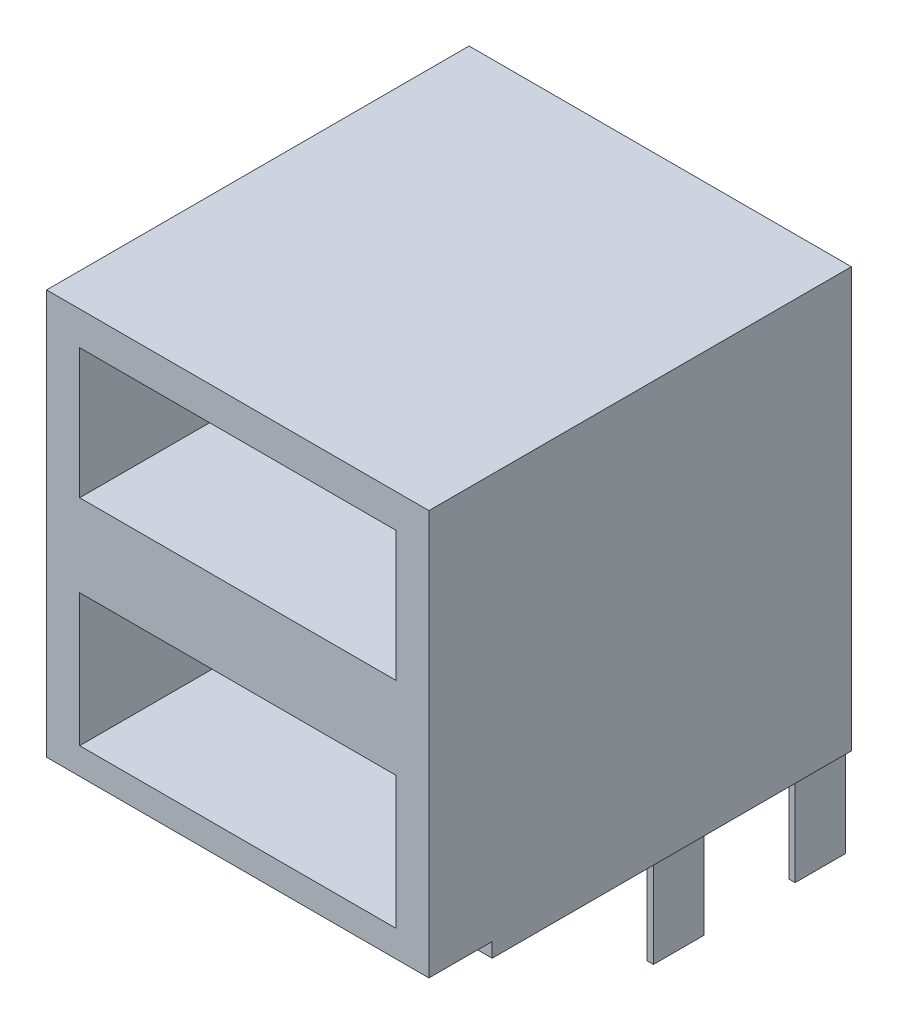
ISO-10303-21;
HEADER;
FILE_DESCRIPTION(('STEP AP214'),'2;1');
FILE_NAME('part.step','',(''),(''),'','','');
FILE_SCHEMA(('AUTOMOTIVE_DESIGN { 1 0 10303 214 1 1 1 1 }'));
ENDSEC;
DATA;
#1=APPLICATION_CONTEXT('core data for automotive mechanical design processes');
#2=APPLICATION_PROTOCOL_DEFINITION('international standard','automotive_design',2000,#1);
#3=PRODUCT_CONTEXT('',#1,'mechanical');
#4=PRODUCT('Part','Part','',(#3));
#5=PRODUCT_RELATED_PRODUCT_CATEGORY('part','',(#4));
#6=PRODUCT_DEFINITION_FORMATION('','',#4);
#7=PRODUCT_DEFINITION_CONTEXT('part definition',#1,'design');
#8=PRODUCT_DEFINITION('design','',#6,#7);
#9=PRODUCT_DEFINITION_SHAPE('','',#8);
#10=(LENGTH_UNIT() NAMED_UNIT(*) SI_UNIT(.MILLI.,.METRE.));
#11=(NAMED_UNIT(*) PLANE_ANGLE_UNIT() SI_UNIT($,.RADIAN.));
#12=(NAMED_UNIT(*) SI_UNIT($,.STERADIAN.) SOLID_ANGLE_UNIT());
#13=UNCERTAINTY_MEASURE_WITH_UNIT(LENGTH_MEASURE(1.E-05),#10,'distance_accuracy_value','');
#14=(GEOMETRIC_REPRESENTATION_CONTEXT(3) GLOBAL_UNCERTAINTY_ASSIGNED_CONTEXT((#13)) GLOBAL_UNIT_ASSIGNED_CONTEXT((#10,
#11,#12)) REPRESENTATION_CONTEXT('',''));
#15=CARTESIAN_POINT('',(0.,0.,0.));
#16=DIRECTION('',(0.,0.,1.));
#17=DIRECTION('',(1.,0.,0.));
#18=AXIS2_PLACEMENT_3D('',#15,#16,#17);
#19=CARTESIAN_POINT('',(-6.35,10.2743,-3.2766));
#20=DIRECTION('',(0.,0.,1.));
#21=DIRECTION('',(0.,-1.,0.));
#22=AXIS2_PLACEMENT_3D('',#19,#20,#21);
#23=PLANE('',#22);
#24=DIRECTION('',(1.,0.,0.));
#25=VECTOR('',#24,1.);
#26=CARTESIAN_POINT('',(-6.35,10.2743,-3.2766));
#27=LINE('',#26,#25);
#28=CARTESIAN_POINT('',(-6.35,10.2743,-3.27660000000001));
#29=VERTEX_POINT('',#28);
#30=CARTESIAN_POINT('',(6.35,10.2743,-3.2766));
#31=VERTEX_POINT('',#30);
#32=EDGE_CURVE('E223',#29,#31,#27,.T.);
#33=ORIENTED_EDGE('',*,*,#32,.T.);
#34=DIRECTION('',(0.,1.,0.));
#35=VECTOR('',#34,1.);
#36=CARTESIAN_POINT('',(6.35,15.494,-3.2766));
#37=LINE('',#36,#35);
#38=CARTESIAN_POINT('',(6.35,15.494,-3.27660000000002));
#39=VERTEX_POINT('',#38);
#40=EDGE_CURVE('E373',#31,#39,#37,.T.);
#41=ORIENTED_EDGE('',*,*,#40,.T.);
#42=DIRECTION('',(1.,0.,0.));
#43=VECTOR('',#42,1.);
#44=CARTESIAN_POINT('',(-6.35,15.494,-3.27660000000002));
#45=LINE('',#44,#43);
#46=CARTESIAN_POINT('',(-6.35,15.494,-3.27660000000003));
#47=VERTEX_POINT('',#46);
#48=EDGE_CURVE('E228',#39,#47,#45,.F.);
#49=ORIENTED_EDGE('',*,*,#48,.T.);
#50=DIRECTION('',(0.,1.,0.));
#51=VECTOR('',#50,1.);
#52=CARTESIAN_POINT('',(-6.35,15.494,-3.27660000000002));
#53=LINE('',#52,#51);
#54=EDGE_CURVE('E226',#47,#29,#53,.F.);
#55=ORIENTED_EDGE('',*,*,#54,.T.);
#56=EDGE_LOOP('',(#33,#41,#49,#55));
#57=FACE_BOUND('',#56,.T.);
#58=ADVANCED_FACE('F17',(#57),#23,.T.);
#59=CARTESIAN_POINT('',(-6.35,6.9723,-3.2766));
#60=DIRECTION('',(0.,0.,1.));
#61=DIRECTION('',(0.,-1.,0.));
#62=AXIS2_PLACEMENT_3D('',#59,#60,#61);
#63=PLANE('',#62);
#64=DIRECTION('',(1.,0.,0.));
#65=VECTOR('',#64,1.);
#66=CARTESIAN_POINT('',(-6.35,1.651,-3.27659999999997));
#67=LINE('',#66,#65);
#68=CARTESIAN_POINT('',(-6.35,1.651,-3.27659999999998));
#69=VERTEX_POINT('',#68);
#70=CARTESIAN_POINT('',(6.35,1.65099999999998,-3.27659999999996));
#71=VERTEX_POINT('',#70);
#72=EDGE_CURVE('E360',#69,#71,#67,.T.);
#73=ORIENTED_EDGE('',*,*,#72,.T.);
#74=DIRECTION('',(0.,1.,0.));
#75=VECTOR('',#74,1.);
#76=CARTESIAN_POINT('',(6.35,6.9723,-3.27659999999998));
#77=LINE('',#76,#75);
#78=CARTESIAN_POINT('',(6.35,6.9723,-3.27659999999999));
#79=VERTEX_POINT('',#78);
#80=EDGE_CURVE('E355',#71,#79,#77,.T.);
#81=ORIENTED_EDGE('',*,*,#80,.T.);
#82=DIRECTION('',(1.,0.,0.));
#83=VECTOR('',#82,1.);
#84=CARTESIAN_POINT('',(-6.35,6.9723,-3.2766));
#85=LINE('',#84,#83);
#86=CARTESIAN_POINT('',(-6.35,6.97229999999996,-3.2766));
#87=VERTEX_POINT('',#86);
#88=EDGE_CURVE('E342',#79,#87,#85,.F.);
#89=ORIENTED_EDGE('',*,*,#88,.T.);
#90=DIRECTION('',(0.,1.,0.));
#91=VECTOR('',#90,1.);
#92=CARTESIAN_POINT('',(-6.35,6.9723,-3.2766));
#93=LINE('',#92,#91);
#94=EDGE_CURVE('E365',#87,#69,#93,.F.);
#95=ORIENTED_EDGE('',*,*,#94,.T.);
#96=EDGE_LOOP('',(#73,#81,#89,#95));
#97=FACE_BOUND('',#96,.T.);
#98=ADVANCED_FACE('F537',(#97),#63,.T.);
#99=CARTESIAN_POINT('',(3.4925,-2.8448,-4.5212));
#100=DIRECTION('',(0.,-1.,0.));
#101=DIRECTION('',(0.,0.,-1.));
#102=AXIS2_PLACEMENT_3D('',#99,#100,#101);
#103=PLANE('',#102);
#104=CARTESIAN_POINT('',(3.4925,-2.84479999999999,-4.5212));
#105=DIRECTION('',(0.,1.,0.));
#106=DIRECTION('',(0.,0.,1.));
#107=AXIS2_PLACEMENT_3D('',#104,#105,#106);
#108=CIRCLE('',#107,0.4572);
#109=CARTESIAN_POINT('',(3.4925,-2.8448,-4.064));
#110=VERTEX_POINT('',#109);
#111=EDGE_CURVE('E20',#110,#110,#108,.T.);
#112=ORIENTED_EDGE('',*,*,#111,.F.);
#113=EDGE_LOOP('',(#112));
#114=FACE_BOUND('',#113,.T.);
#115=ADVANCED_FACE('F735',(#114),#103,.T.);
#116=CARTESIAN_POINT('',(-1.0033,-2.8448,-4.5212));
#117=DIRECTION('',(0.,-1.,0.));
#118=DIRECTION('',(0.,0.,-1.));
#119=AXIS2_PLACEMENT_3D('',#116,#117,#118);
#120=PLANE('',#119);
#121=CARTESIAN_POINT('',(-1.0033,-2.84479999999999,-4.5212));
#122=DIRECTION('',(0.,1.,0.));
#123=DIRECTION('',(0.,0.,1.));
#124=AXIS2_PLACEMENT_3D('',#121,#122,#123);
#125=CIRCLE('',#124,0.4572);
#126=CARTESIAN_POINT('',(-1.0033,-2.8448,-4.064));
#127=VERTEX_POINT('',#126);
#128=EDGE_CURVE('E328',#127,#127,#125,.T.);
#129=ORIENTED_EDGE('',*,*,#128,.F.);
#130=EDGE_LOOP('',(#129));
#131=FACE_BOUND('',#130,.T.);
#132=ADVANCED_FACE('F731',(#131),#120,.T.);
#133=CARTESIAN_POINT('',(1.0033,-2.8448,-7.1374));
#134=DIRECTION('',(0.,-1.,0.));
#135=DIRECTION('',(0.,0.,-1.));
#136=AXIS2_PLACEMENT_3D('',#133,#134,#135);
#137=PLANE('',#136);
#138=CARTESIAN_POINT('',(1.0033,-2.84479999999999,-7.1374));
#139=DIRECTION('',(0.,1.,0.));
#140=DIRECTION('',(0.,0.,1.));
#141=AXIS2_PLACEMENT_3D('',#138,#139,#140);
#142=CIRCLE('',#141,0.4572);
#143=CARTESIAN_POINT('',(1.0033,-2.8448,-6.6802));
#144=VERTEX_POINT('',#143);
#145=EDGE_CURVE('E326',#144,#144,#142,.T.);
#146=ORIENTED_EDGE('',*,*,#145,.F.);
#147=EDGE_LOOP('',(#146));
#148=FACE_BOUND('',#147,.T.);
#149=ADVANCED_FACE('F727',(#148),#137,.T.);
#150=CARTESIAN_POINT('',(-3.4925,-2.8448,-7.1374));
#151=DIRECTION('',(0.,-1.,0.));
#152=DIRECTION('',(0.,0.,-1.));
#153=AXIS2_PLACEMENT_3D('',#150,#151,#152);
#154=PLANE('',#153);
#155=CARTESIAN_POINT('',(-3.4925,-2.84479999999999,-7.1374));
#156=DIRECTION('',(0.,1.,0.));
#157=DIRECTION('',(0.,0.,1.));
#158=AXIS2_PLACEMENT_3D('',#155,#156,#157);
#159=CIRCLE('',#158,0.4572);
#160=CARTESIAN_POINT('',(-3.4925,-2.8448,-6.6802));
#161=VERTEX_POINT('',#160);
#162=EDGE_CURVE('E322',#161,#161,#159,.T.);
#163=ORIENTED_EDGE('',*,*,#162,.F.);
#164=EDGE_LOOP('',(#163));
#165=FACE_BOUND('',#164,.T.);
#166=ADVANCED_FACE('F724',(#165),#154,.T.);
#167=CARTESIAN_POINT('',(7.16915,-3.7084,-0.7874));
#168=DIRECTION('',(0.,0.,-1.));
#169=DIRECTION('',(-1.,0.,0.));
#170=AXIS2_PLACEMENT_3D('',#167,#168,#169);
#171=PLANE('',#170);
#172=DIRECTION('',(0.,1.,0.));
#173=VECTOR('',#172,1.);
#174=CARTESIAN_POINT('',(7.42315,-3.7084,-0.787400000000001));
#175=LINE('',#174,#173);
#176=CARTESIAN_POINT('',(7.42315,-3.7084,-0.787400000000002));
#177=VERTEX_POINT('',#176);
#178=CARTESIAN_POINT('',(7.42315,0.,-0.787400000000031));
#179=VERTEX_POINT('',#178);
#180=EDGE_CURVE('E469',#177,#179,#175,.T.);
#181=ORIENTED_EDGE('',*,*,#180,.T.);
#182=DIRECTION('',(-1.,0.,0.));
#183=VECTOR('',#182,1.);
#184=CARTESIAN_POINT('',(7.16915,0.,-0.787400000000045));
#185=LINE('',#184,#183);
#186=CARTESIAN_POINT('',(7.16915,0.,-0.787400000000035));
#187=VERTEX_POINT('',#186);
#188=EDGE_CURVE('E278',#187,#179,#185,.F.);
#189=ORIENTED_EDGE('',*,*,#188,.F.);
#190=DIRECTION('',(0.,1.,0.));
#191=VECTOR('',#190,1.);
#192=CARTESIAN_POINT('',(7.16915,-3.7084,-0.787400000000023));
#193=LINE('',#192,#191);
#194=CARTESIAN_POINT('',(7.16915,-3.7084,-0.787400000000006));
#195=VERTEX_POINT('',#194);
#196=EDGE_CURVE('E474',#187,#195,#193,.F.);
#197=ORIENTED_EDGE('',*,*,#196,.T.);
#198=DIRECTION('',(1.,0.,0.));
#199=VECTOR('',#198,1.);
#200=CARTESIAN_POINT('',(7.16915,-3.7084,-0.7874));
#201=LINE('',#200,#199);
#202=EDGE_CURVE('E270',#195,#177,#201,.T.);
#203=ORIENTED_EDGE('',*,*,#202,.T.);
#204=EDGE_LOOP('',(#181,#189,#197,#203));
#205=FACE_BOUND('',#204,.T.);
#206=ADVANCED_FACE('F721',(#205),#171,.F.);
#207=CARTESIAN_POINT('',(7.16915,-3.7084,-2.8194));
#208=DIRECTION('',(0.,0.,1.));
#209=DIRECTION('',(1.,0.,0.));
#210=AXIS2_PLACEMENT_3D('',#207,#208,#209);
#211=PLANE('',#210);
#212=DIRECTION('',(0.,1.,0.));
#213=VECTOR('',#212,1.);
#214=CARTESIAN_POINT('',(7.16915,-3.7084,-2.8194));
#215=LINE('',#214,#213);
#216=CARTESIAN_POINT('',(7.16915,-3.70840000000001,-2.8194));
#217=VERTEX_POINT('',#216);
#218=CARTESIAN_POINT('',(7.16915,0.,-2.81940000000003));
#219=VERTEX_POINT('',#218);
#220=EDGE_CURVE('E325',#217,#219,#215,.T.);
#221=ORIENTED_EDGE('',*,*,#220,.T.);
#222=DIRECTION('',(1.,0.,0.));
#223=VECTOR('',#222,1.);
#224=CARTESIAN_POINT('',(7.16915,0.,-2.81940000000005));
#225=LINE('',#224,#223);
#226=CARTESIAN_POINT('',(7.42315,0.,-2.81940000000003));
#227=VERTEX_POINT('',#226);
#228=EDGE_CURVE('E276',#227,#219,#225,.F.);
#229=ORIENTED_EDGE('',*,*,#228,.F.);
#230=DIRECTION('',(0.,1.,0.));
#231=VECTOR('',#230,1.);
#232=CARTESIAN_POINT('',(7.42315,-3.7084,-2.81940000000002));
#233=LINE('',#232,#231);
#234=CARTESIAN_POINT('',(7.42315,-3.70840000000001,-2.8194));
#235=VERTEX_POINT('',#234);
#236=EDGE_CURVE('E466',#227,#235,#233,.F.);
#237=ORIENTED_EDGE('',*,*,#236,.T.);
#238=DIRECTION('',(1.,0.,0.));
#239=VECTOR('',#238,1.);
#240=CARTESIAN_POINT('',(7.16915,-3.70840000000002,-2.8194));
#241=LINE('',#240,#239);
#242=EDGE_CURVE('E273',#235,#217,#241,.F.);
#243=ORIENTED_EDGE('',*,*,#242,.T.);
#244=EDGE_LOOP('',(#221,#229,#237,#243));
#245=FACE_BOUND('',#244,.T.);
#246=ADVANCED_FACE('F481',(#245),#211,.F.);
#247=CARTESIAN_POINT('',(7.16915,-3.7084,-0.7874));
#248=DIRECTION('',(0.,1.,0.));
#249=DIRECTION('',(0.,0.,1.));
#250=AXIS2_PLACEMENT_3D('',#247,#248,#249);
#251=PLANE('',#250);
#252=ORIENTED_EDGE('',*,*,#202,.F.);
#253=DIRECTION('',(0.,0.,-1.));
#254=VECTOR('',#253,1.);
#255=CARTESIAN_POINT('',(7.16915,-3.7084,-2.8194));
#256=LINE('',#255,#254);
#257=EDGE_CURVE('E472',#195,#217,#256,.T.);
#258=ORIENTED_EDGE('',*,*,#257,.T.);
#259=ORIENTED_EDGE('',*,*,#242,.F.);
#260=DIRECTION('',(0.,0.,1.));
#261=VECTOR('',#260,1.);
#262=CARTESIAN_POINT('',(7.42315,-3.70840000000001,-2.8194));
#263=LINE('',#262,#261);
#264=EDGE_CURVE('E463',#235,#177,#263,.T.);
#265=ORIENTED_EDGE('',*,*,#264,.T.);
#266=EDGE_LOOP('',(#252,#258,#259,#265));
#267=FACE_BOUND('',#266,.T.);
#268=ADVANCED_FACE('F708',(#267),#251,.F.);
#269=CARTESIAN_POINT('',(-7.16915,-3.7084,-2.8194));
#270=DIRECTION('',(0.,0.,1.));
#271=DIRECTION('',(0.,-1.,0.));
#272=AXIS2_PLACEMENT_3D('',#269,#270,#271);
#273=PLANE('',#272);
#274=DIRECTION('',(0.,1.,0.));
#275=VECTOR('',#274,1.);
#276=CARTESIAN_POINT('',(-7.42315,-3.7084,-2.8194));
#277=LINE('',#276,#275);
#278=CARTESIAN_POINT('',(-7.42315,-3.7084,-2.8194));
#279=VERTEX_POINT('',#278);
#280=CARTESIAN_POINT('',(-7.42315,0.,-2.81940000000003));
#281=VERTEX_POINT('',#280);
#282=EDGE_CURVE('E451',#279,#281,#277,.T.);
#283=ORIENTED_EDGE('',*,*,#282,.T.);
#284=DIRECTION('',(1.,0.,0.));
#285=VECTOR('',#284,1.);
#286=CARTESIAN_POINT('',(-7.16915,0.,-2.81940000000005));
#287=LINE('',#286,#285);
#288=CARTESIAN_POINT('',(-7.16915,0.,-2.81940000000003));
#289=VERTEX_POINT('',#288);
#290=EDGE_CURVE('E268',#289,#281,#287,.F.);
#291=ORIENTED_EDGE('',*,*,#290,.F.);
#292=DIRECTION('',(0.,1.,0.));
#293=VECTOR('',#292,1.);
#294=CARTESIAN_POINT('',(-7.16915,-3.7084,-2.81940000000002));
#295=LINE('',#294,#293);
#296=CARTESIAN_POINT('',(-7.16915,-3.7084,-2.81940000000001));
#297=VERTEX_POINT('',#296);
#298=EDGE_CURVE('E457',#289,#297,#295,.F.);
#299=ORIENTED_EDGE('',*,*,#298,.T.);
#300=DIRECTION('',(1.,0.,0.));
#301=VECTOR('',#300,1.);
#302=CARTESIAN_POINT('',(-7.16915,-3.7084,-2.8194));
#303=LINE('',#302,#301);
#304=EDGE_CURVE('E260',#297,#279,#303,.F.);
#305=ORIENTED_EDGE('',*,*,#304,.T.);
#306=EDGE_LOOP('',(#283,#291,#299,#305));
#307=FACE_BOUND('',#306,.T.);
#308=ADVANCED_FACE('F706',(#307),#273,.F.);
#309=CARTESIAN_POINT('',(-7.16915,-3.7084,-0.7874));
#310=DIRECTION('',(0.,0.,-1.));
#311=DIRECTION('',(0.,1.,0.));
#312=AXIS2_PLACEMENT_3D('',#309,#310,#311);
#313=PLANE('',#312);
#314=DIRECTION('',(0.,1.,0.));
#315=VECTOR('',#314,1.);
#316=CARTESIAN_POINT('',(-7.16915,-3.7084,-0.7874));
#317=LINE('',#316,#315);
#318=CARTESIAN_POINT('',(-7.16915,-3.70839999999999,-0.7874));
#319=VERTEX_POINT('',#318);
#320=CARTESIAN_POINT('',(-7.16915,0.,-0.787400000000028));
#321=VERTEX_POINT('',#320);
#322=EDGE_CURVE('E460',#319,#321,#317,.T.);
#323=ORIENTED_EDGE('',*,*,#322,.T.);
#324=DIRECTION('',(1.,0.,0.));
#325=VECTOR('',#324,1.);
#326=CARTESIAN_POINT('',(-7.16915,0.,-0.787400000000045));
#327=LINE('',#326,#325);
#328=CARTESIAN_POINT('',(-7.42315,0.,-0.787400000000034));
#329=VERTEX_POINT('',#328);
#330=EDGE_CURVE('E266',#329,#321,#327,.T.);
#331=ORIENTED_EDGE('',*,*,#330,.F.);
#332=DIRECTION('',(0.,1.,0.));
#333=VECTOR('',#332,1.);
#334=CARTESIAN_POINT('',(-7.42315,-3.7084,-0.787400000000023));
#335=LINE('',#334,#333);
#336=CARTESIAN_POINT('',(-7.42315,-3.70839999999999,-0.787400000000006));
#337=VERTEX_POINT('',#336);
#338=EDGE_CURVE('E448',#329,#337,#335,.F.);
#339=ORIENTED_EDGE('',*,*,#338,.T.);
#340=DIRECTION('',(1.,0.,0.));
#341=VECTOR('',#340,1.);
#342=CARTESIAN_POINT('',(-7.16915,-3.70839999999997,-0.7874));
#343=LINE('',#342,#341);
#344=EDGE_CURVE('E263',#337,#319,#343,.T.);
#345=ORIENTED_EDGE('',*,*,#344,.T.);
#346=EDGE_LOOP('',(#323,#331,#339,#345));
#347=FACE_BOUND('',#346,.T.);
#348=ADVANCED_FACE('F701',(#347),#313,.F.);
#349=CARTESIAN_POINT('',(-7.16915,-3.7084,-2.8194));
#350=DIRECTION('',(0.,1.,0.));
#351=DIRECTION('',(0.,0.,1.));
#352=AXIS2_PLACEMENT_3D('',#349,#350,#351);
#353=PLANE('',#352);
#354=ORIENTED_EDGE('',*,*,#304,.F.);
#355=DIRECTION('',(0.,0.,1.));
#356=VECTOR('',#355,1.);
#357=CARTESIAN_POINT('',(-7.16915,-3.7084,-0.7874));
#358=LINE('',#357,#356);
#359=EDGE_CURVE('E454',#297,#319,#358,.T.);
#360=ORIENTED_EDGE('',*,*,#359,.T.);
#361=ORIENTED_EDGE('',*,*,#344,.F.);
#362=DIRECTION('',(0.,0.,-1.));
#363=VECTOR('',#362,1.);
#364=CARTESIAN_POINT('',(-7.42315,-3.70839999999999,-0.7874));
#365=LINE('',#364,#363);
#366=EDGE_CURVE('E321',#337,#279,#365,.T.);
#367=ORIENTED_EDGE('',*,*,#366,.T.);
#368=EDGE_LOOP('',(#354,#360,#361,#367));
#369=FACE_BOUND('',#368,.T.);
#370=ADVANCED_FACE('F704',(#369),#353,.F.);
#371=CARTESIAN_POINT('',(-3.4925,-2.8448,-4.5212));
#372=DIRECTION('',(0.,-1.,0.));
#373=DIRECTION('',(0.,0.,-1.));
#374=AXIS2_PLACEMENT_3D('',#371,#372,#373);
#375=PLANE('',#374);
#376=CARTESIAN_POINT('',(-3.4925,-2.84479999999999,-4.5212));
#377=DIRECTION('',(0.,1.,0.));
#378=DIRECTION('',(0.,0.,1.));
#379=AXIS2_PLACEMENT_3D('',#376,#377,#378);
#380=CIRCLE('',#379,0.4572);
#381=CARTESIAN_POINT('',(-3.4925,-2.8448,-4.064));
#382=VERTEX_POINT('',#381);
#383=EDGE_CURVE('E318',#382,#382,#380,.T.);
#384=ORIENTED_EDGE('',*,*,#383,.F.);
#385=EDGE_LOOP('',(#384));
#386=FACE_BOUND('',#385,.T.);
#387=ADVANCED_FACE('F793',(#386),#375,.T.);
#388=CARTESIAN_POINT('',(-1.0033,-2.8448,-7.1374));
#389=DIRECTION('',(0.,-1.,0.));
#390=DIRECTION('',(0.,0.,-1.));
#391=AXIS2_PLACEMENT_3D('',#388,#389,#390);
#392=PLANE('',#391);
#393=CARTESIAN_POINT('',(-1.0033,-2.84479999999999,-7.1374));
#394=DIRECTION('',(0.,1.,0.));
#395=DIRECTION('',(0.,0.,1.));
#396=AXIS2_PLACEMENT_3D('',#393,#394,#395);
#397=CIRCLE('',#396,0.4572);
#398=CARTESIAN_POINT('',(-1.0033,-2.8448,-6.6802));
#399=VERTEX_POINT('',#398);
#400=EDGE_CURVE('E315',#399,#399,#397,.T.);
#401=ORIENTED_EDGE('',*,*,#400,.F.);
#402=EDGE_LOOP('',(#401));
#403=FACE_BOUND('',#402,.T.);
#404=ADVANCED_FACE('F799',(#403),#392,.T.);
#405=CARTESIAN_POINT('',(3.4925,-2.8448,-7.1374));
#406=DIRECTION('',(0.,-1.,0.));
#407=DIRECTION('',(0.,0.,-1.));
#408=AXIS2_PLACEMENT_3D('',#405,#406,#407);
#409=PLANE('',#408);
#410=CARTESIAN_POINT('',(3.4925,-2.84479999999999,-7.1374));
#411=DIRECTION('',(0.,1.,0.));
#412=DIRECTION('',(0.,0.,1.));
#413=AXIS2_PLACEMENT_3D('',#410,#411,#412);
#414=CIRCLE('',#413,0.4572);
#415=CARTESIAN_POINT('',(3.4925,-2.8448,-6.6802));
#416=VERTEX_POINT('',#415);
#417=EDGE_CURVE('E312',#416,#416,#414,.T.);
#418=ORIENTED_EDGE('',*,*,#417,.F.);
#419=EDGE_LOOP('',(#418));
#420=FACE_BOUND('',#419,.T.);
#421=ADVANCED_FACE('F807',(#420),#409,.T.);
#422=CARTESIAN_POINT('',(1.0033,-2.8448,-4.5212));
#423=DIRECTION('',(0.,-1.,0.));
#424=DIRECTION('',(0.,0.,-1.));
#425=AXIS2_PLACEMENT_3D('',#422,#423,#424);
#426=PLANE('',#425);
#427=CARTESIAN_POINT('',(1.0033,-2.84479999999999,-4.5212));
#428=DIRECTION('',(0.,1.,0.));
#429=DIRECTION('',(0.,0.,1.));
#430=AXIS2_PLACEMENT_3D('',#427,#428,#429);
#431=CIRCLE('',#430,0.4572);
#432=CARTESIAN_POINT('',(1.0033,-2.8448,-4.064));
#433=VERTEX_POINT('',#432);
#434=EDGE_CURVE('E308',#433,#433,#431,.T.);
#435=ORIENTED_EDGE('',*,*,#434,.F.);
#436=EDGE_LOOP('',(#435));
#437=FACE_BOUND('',#436,.T.);
#438=ADVANCED_FACE('F815',(#437),#426,.T.);
#439=CARTESIAN_POINT('',(7.42315,-3.7084,-6.477));
#440=DIRECTION('',(0.,0.,-1.));
#441=DIRECTION('',(0.,1.,0.));
#442=AXIS2_PLACEMENT_3D('',#439,#440,#441);
#443=PLANE('',#442);
#444=DIRECTION('',(0.,1.,0.));
#445=VECTOR('',#444,1.);
#446=CARTESIAN_POINT('',(7.42315,-3.7084,-6.477));
#447=LINE('',#446,#445);
#448=CARTESIAN_POINT('',(7.42315,-3.7084,-6.477));
#449=VERTEX_POINT('',#448);
#450=CARTESIAN_POINT('',(7.42315,0.,-6.47700000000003));
#451=VERTEX_POINT('',#450);
#452=EDGE_CURVE('E435',#449,#451,#447,.T.);
#453=ORIENTED_EDGE('',*,*,#452,.T.);
#454=DIRECTION('',(1.,0.,0.));
#455=VECTOR('',#454,1.);
#456=CARTESIAN_POINT('',(7.42315,0.,-6.47700000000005));
#457=LINE('',#456,#455);
#458=CARTESIAN_POINT('',(7.16915,0.,-6.47700000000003));
#459=VERTEX_POINT('',#458);
#460=EDGE_CURVE('E258',#459,#451,#457,.T.);
#461=ORIENTED_EDGE('',*,*,#460,.F.);
#462=DIRECTION('',(0.,1.,0.));
#463=VECTOR('',#462,1.);
#464=CARTESIAN_POINT('',(7.16915,-3.7084,-6.47700000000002));
#465=LINE('',#464,#463);
#466=CARTESIAN_POINT('',(7.16915,-3.7084,-6.47700000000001));
#467=VERTEX_POINT('',#466);
#468=EDGE_CURVE('E429',#459,#467,#465,.F.);
#469=ORIENTED_EDGE('',*,*,#468,.T.);
#470=DIRECTION('',(1.,0.,0.));
#471=VECTOR('',#470,1.);
#472=CARTESIAN_POINT('',(7.42315,-3.7084,-6.477));
#473=LINE('',#472,#471);
#474=EDGE_CURVE('E256',#449,#467,#473,.F.);
#475=ORIENTED_EDGE('',*,*,#474,.F.);
#476=EDGE_LOOP('',(#453,#461,#469,#475));
#477=FACE_BOUND('',#476,.T.);
#478=ADVANCED_FACE('F823',(#477),#443,.F.);
#479=CARTESIAN_POINT('',(7.42315,-3.7084,-6.477));
#480=DIRECTION('',(0.,-1.,0.));
#481=DIRECTION('',(0.,0.,-1.));
#482=AXIS2_PLACEMENT_3D('',#479,#480,#481);
#483=PLANE('',#482);
#484=ORIENTED_EDGE('',*,*,#474,.T.);
#485=DIRECTION('',(0.,0.,-1.));
#486=VECTOR('',#485,1.);
#487=CARTESIAN_POINT('',(7.16915,-3.7084,-8.509));
#488=LINE('',#487,#486);
#489=CARTESIAN_POINT('',(7.16915,-3.70840000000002,-8.509));
#490=VERTEX_POINT('',#489);
#491=EDGE_CURVE('E426',#467,#490,#488,.T.);
#492=ORIENTED_EDGE('',*,*,#491,.T.);
#493=DIRECTION('',(1.,0.,0.));
#494=VECTOR('',#493,1.);
#495=CARTESIAN_POINT('',(7.42315,-3.70840000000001,-8.509));
#496=LINE('',#495,#494);
#497=CARTESIAN_POINT('',(7.42315,-3.70840000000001,-8.50900000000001));
#498=VERTEX_POINT('',#497);
#499=EDGE_CURVE('E254',#490,#498,#496,.T.);
#500=ORIENTED_EDGE('',*,*,#499,.T.);
#501=DIRECTION('',(0.,0.,1.));
#502=VECTOR('',#501,1.);
#503=CARTESIAN_POINT('',(7.42315,-3.70840000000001,-8.509));
#504=LINE('',#503,#502);
#505=EDGE_CURVE('E438',#498,#449,#504,.T.);
#506=ORIENTED_EDGE('',*,*,#505,.T.);
#507=EDGE_LOOP('',(#484,#492,#500,#506));
#508=FACE_BOUND('',#507,.T.);
#509=ADVANCED_FACE('F831',(#508),#483,.T.);
#510=CARTESIAN_POINT('',(7.42315,-3.7084,-8.509));
#511=DIRECTION('',(0.,0.,1.));
#512=DIRECTION('',(0.,-1.,0.));
#513=AXIS2_PLACEMENT_3D('',#510,#511,#512);
#514=PLANE('',#513);
#515=DIRECTION('',(0.,1.,0.));
#516=VECTOR('',#515,1.);
#517=CARTESIAN_POINT('',(7.16915,-3.7084,-8.509));
#518=LINE('',#517,#516);
#519=CARTESIAN_POINT('',(7.16915,0.,-8.50900000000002));
#520=VERTEX_POINT('',#519);
#521=EDGE_CURVE('E423',#490,#520,#518,.T.);
#522=ORIENTED_EDGE('',*,*,#521,.T.);
#523=DIRECTION('',(1.,0.,0.));
#524=VECTOR('',#523,1.);
#525=CARTESIAN_POINT('',(7.42315,0.,-8.50900000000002));
#526=LINE('',#525,#524);
#527=CARTESIAN_POINT('',(7.42315,0.,-8.50900000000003));
#528=VERTEX_POINT('',#527);
#529=EDGE_CURVE('E336',#520,#528,#526,.T.);
#530=ORIENTED_EDGE('',*,*,#529,.T.);
#531=DIRECTION('',(0.,1.,0.));
#532=VECTOR('',#531,1.);
#533=CARTESIAN_POINT('',(7.42315,-3.7084,-8.50900000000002));
#534=LINE('',#533,#532);
#535=EDGE_CURVE('E441',#528,#498,#534,.F.);
#536=ORIENTED_EDGE('',*,*,#535,.T.);
#537=ORIENTED_EDGE('',*,*,#499,.F.);
#538=EDGE_LOOP('',(#522,#530,#536,#537));
#539=FACE_BOUND('',#538,.T.);
#540=ADVANCED_FACE('F839',(#539),#514,.F.);
#541=CARTESIAN_POINT('',(-7.16915,-3.7084,-6.477));
#542=DIRECTION('',(0.,0.,-1.));
#543=DIRECTION('',(0.,1.,0.));
#544=AXIS2_PLACEMENT_3D('',#541,#542,#543);
#545=PLANE('',#544);
#546=DIRECTION('',(0.,1.,0.));
#547=VECTOR('',#546,1.);
#548=CARTESIAN_POINT('',(-7.16915,-3.7084,-6.477));
#549=LINE('',#548,#547);
#550=CARTESIAN_POINT('',(-7.16915,-3.70839999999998,-6.477));
#551=VERTEX_POINT('',#550);
#552=CARTESIAN_POINT('',(-7.16915,0.,-6.47700000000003));
#553=VERTEX_POINT('',#552);
#554=EDGE_CURVE('E412',#551,#553,#549,.T.);
#555=ORIENTED_EDGE('',*,*,#554,.T.);
#556=DIRECTION('',(1.,0.,0.));
#557=VECTOR('',#556,1.);
#558=CARTESIAN_POINT('',(-7.16915,0.,-6.47700000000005));
#559=LINE('',#558,#557);
#560=CARTESIAN_POINT('',(-7.42315,0.,-6.47700000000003));
#561=VERTEX_POINT('',#560);
#562=EDGE_CURVE('E252',#561,#553,#559,.T.);
#563=ORIENTED_EDGE('',*,*,#562,.F.);
#564=DIRECTION('',(0.,1.,0.));
#565=VECTOR('',#564,1.);
#566=CARTESIAN_POINT('',(-7.42315,-3.7084,-6.47700000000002));
#567=LINE('',#566,#565);
#568=CARTESIAN_POINT('',(-7.42315,-3.70839999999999,-6.47700000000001));
#569=VERTEX_POINT('',#568);
#570=EDGE_CURVE('E407',#561,#569,#567,.F.);
#571=ORIENTED_EDGE('',*,*,#570,.T.);
#572=DIRECTION('',(1.,0.,0.));
#573=VECTOR('',#572,1.);
#574=CARTESIAN_POINT('',(-7.16915,-3.70839999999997,-6.477));
#575=LINE('',#574,#573);
#576=EDGE_CURVE('E250',#569,#551,#575,.T.);
#577=ORIENTED_EDGE('',*,*,#576,.T.);
#578=EDGE_LOOP('',(#555,#563,#571,#577));
#579=FACE_BOUND('',#578,.T.);
#580=ADVANCED_FACE('F666',(#579),#545,.F.);
#581=CARTESIAN_POINT('',(-7.16915,-3.7084,-8.509));
#582=DIRECTION('',(0.,1.,0.));
#583=DIRECTION('',(0.,0.,1.));
#584=AXIS2_PLACEMENT_3D('',#581,#582,#583);
#585=PLANE('',#584);
#586=DIRECTION('',(1.,0.,0.));
#587=VECTOR('',#586,1.);
#588=CARTESIAN_POINT('',(-7.16915,-3.7084,-8.509));
#589=LINE('',#588,#587);
#590=CARTESIAN_POINT('',(-7.42315,-3.7084,-8.509));
#591=VERTEX_POINT('',#590);
#592=CARTESIAN_POINT('',(-7.16915,-3.7084,-8.50900000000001));
#593=VERTEX_POINT('',#592);
#594=EDGE_CURVE('E234',#591,#593,#589,.T.);
#595=ORIENTED_EDGE('',*,*,#594,.T.);
#596=DIRECTION('',(0.,0.,1.));
#597=VECTOR('',#596,1.);
#598=CARTESIAN_POINT('',(-7.16915,-3.7084,-6.477));
#599=LINE('',#598,#597);
#600=EDGE_CURVE('E415',#593,#551,#599,.T.);
#601=ORIENTED_EDGE('',*,*,#600,.T.);
#602=ORIENTED_EDGE('',*,*,#576,.F.);
#603=DIRECTION('',(0.,0.,-1.));
#604=VECTOR('',#603,1.);
#605=CARTESIAN_POINT('',(-7.42315,-3.70839999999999,-6.477));
#606=LINE('',#605,#604);
#607=EDGE_CURVE('E404',#569,#591,#606,.T.);
#608=ORIENTED_EDGE('',*,*,#607,.T.);
#609=EDGE_LOOP('',(#595,#601,#602,#608));
#610=FACE_BOUND('',#609,.T.);
#611=ADVANCED_FACE('F664',(#610),#585,.F.);
#612=CARTESIAN_POINT('',(-7.16915,-3.7084,-8.509));
#613=DIRECTION('',(0.,0.,1.));
#614=DIRECTION('',(0.,-1.,0.));
#615=AXIS2_PLACEMENT_3D('',#612,#613,#614);
#616=PLANE('',#615);
#617=DIRECTION('',(0.,1.,0.));
#618=VECTOR('',#617,1.);
#619=CARTESIAN_POINT('',(-7.42315,-3.7084,-8.509));
#620=LINE('',#619,#618);
#621=CARTESIAN_POINT('',(-7.42315,0.,-8.50900000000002));
#622=VERTEX_POINT('',#621);
#623=EDGE_CURVE('E401',#591,#622,#620,.T.);
#624=ORIENTED_EDGE('',*,*,#623,.T.);
#625=DIRECTION('',(1.,0.,0.));
#626=VECTOR('',#625,1.);
#627=CARTESIAN_POINT('',(-7.16915,0.,-8.50900000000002));
#628=LINE('',#627,#626);
#629=CARTESIAN_POINT('',(-7.16915,0.,-8.50900000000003));
#630=VERTEX_POINT('',#629);
#631=EDGE_CURVE('E333',#630,#622,#628,.F.);
#632=ORIENTED_EDGE('',*,*,#631,.F.);
#633=DIRECTION('',(0.,1.,0.));
#634=VECTOR('',#633,1.);
#635=CARTESIAN_POINT('',(-7.16915,-3.7084,-8.50900000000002));
#636=LINE('',#635,#634);
#637=EDGE_CURVE('E418',#630,#593,#636,.F.);
#638=ORIENTED_EDGE('',*,*,#637,.T.);
#639=ORIENTED_EDGE('',*,*,#594,.F.);
#640=EDGE_LOOP('',(#624,#632,#638,#639));
#641=FACE_BOUND('',#640,.T.);
#642=ADVANCED_FACE('F658',(#641),#616,.F.);
#643=CARTESIAN_POINT('',(-6.35,15.494,-3.2766));
#644=DIRECTION('',(-1.,0.,0.));
#645=DIRECTION('',(0.,0.,1.));
#646=AXIS2_PLACEMENT_3D('',#643,#644,#645);
#647=PLANE('',#646);
#648=DIRECTION('',(0.,0.,1.));
#649=VECTOR('',#648,1.);
#650=CARTESIAN_POINT('',(-6.35,15.494,-3.2766));
#651=LINE('',#650,#649);
#652=CARTESIAN_POINT('',(-6.35,15.4940000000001,8.48360000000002));
#653=VERTEX_POINT('',#652);
#654=EDGE_CURVE('E371',#47,#653,#651,.T.);
#655=ORIENTED_EDGE('',*,*,#654,.T.);
#656=DIRECTION('',(0.,1.,0.));
#657=VECTOR('',#656,1.);
#658=CARTESIAN_POINT('',(-6.35,16.8402,8.4836));
#659=LINE('',#658,#657);
#660=CARTESIAN_POINT('',(-6.35,10.2742999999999,8.48360000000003));
#661=VERTEX_POINT('',#660);
#662=EDGE_CURVE('E245',#653,#661,#659,.F.);
#663=ORIENTED_EDGE('',*,*,#662,.T.);
#664=DIRECTION('',(0.,0.,-1.));
#665=VECTOR('',#664,1.);
#666=CARTESIAN_POINT('',(-6.35,10.2743,-3.2766));
#667=LINE('',#666,#665);
#668=EDGE_CURVE('E233',#661,#29,#667,.T.);
#669=ORIENTED_EDGE('',*,*,#668,.T.);
#670=ORIENTED_EDGE('',*,*,#54,.F.);
#671=EDGE_LOOP('',(#655,#663,#669,#670));
#672=FACE_BOUND('',#671,.T.);
#673=ADVANCED_FACE('F244',(#672),#647,.F.);
#674=CARTESIAN_POINT('',(-6.35,10.2743,-3.2766));
#675=DIRECTION('',(0.,-1.,0.));
#676=DIRECTION('',(0.,0.,-1.));
#677=AXIS2_PLACEMENT_3D('',#674,#675,#676);
#678=PLANE('',#677);
#679=ORIENTED_EDGE('',*,*,#668,.F.);
#680=DIRECTION('',(1.,0.,0.));
#681=VECTOR('',#680,1.);
#682=CARTESIAN_POINT('',(-7.67715,10.2742999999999,8.48360000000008));
#683=LINE('',#682,#681);
#684=CARTESIAN_POINT('',(6.35,10.2742999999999,8.48360000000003));
#685=VERTEX_POINT('',#684);
#686=EDGE_CURVE('E385',#661,#685,#683,.T.);
#687=ORIENTED_EDGE('',*,*,#686,.T.);
#688=DIRECTION('',(0.,0.,-1.));
#689=VECTOR('',#688,1.);
#690=CARTESIAN_POINT('',(6.35,10.2742999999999,-3.2766));
#691=LINE('',#690,#689);
#692=EDGE_CURVE('E241',#685,#31,#691,.T.);
#693=ORIENTED_EDGE('',*,*,#692,.T.);
#694=ORIENTED_EDGE('',*,*,#32,.F.);
#695=EDGE_LOOP('',(#679,#687,#693,#694));
#696=FACE_BOUND('',#695,.T.);
#697=ADVANCED_FACE('F238',(#696),#678,.F.);
#698=CARTESIAN_POINT('',(6.35,15.494,-3.2766));
#699=DIRECTION('',(1.,0.,0.));
#700=DIRECTION('',(0.,0.,-1.));
#701=AXIS2_PLACEMENT_3D('',#698,#699,#700);
#702=PLANE('',#701);
#703=ORIENTED_EDGE('',*,*,#692,.F.);
#704=DIRECTION('',(0.,1.,0.));
#705=VECTOR('',#704,1.);
#706=CARTESIAN_POINT('',(6.35,16.8402,8.4836));
#707=LINE('',#706,#705);
#708=CARTESIAN_POINT('',(6.35,15.494,8.48360000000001));
#709=VERTEX_POINT('',#708);
#710=EDGE_CURVE('E382',#685,#709,#707,.T.);
#711=ORIENTED_EDGE('',*,*,#710,.T.);
#712=DIRECTION('',(0.,0.,1.));
#713=VECTOR('',#712,1.);
#714=CARTESIAN_POINT('',(6.35,15.494,-3.2766));
#715=LINE('',#714,#713);
#716=EDGE_CURVE('E368',#709,#39,#715,.F.);
#717=ORIENTED_EDGE('',*,*,#716,.T.);
#718=ORIENTED_EDGE('',*,*,#40,.F.);
#719=EDGE_LOOP('',(#703,#711,#717,#718));
#720=FACE_BOUND('',#719,.T.);
#721=ADVANCED_FACE('F380',(#720),#702,.F.);
#722=CARTESIAN_POINT('',(-6.35,15.494,-3.2766));
#723=DIRECTION('',(0.,1.,0.));
#724=DIRECTION('',(0.,0.,1.));
#725=AXIS2_PLACEMENT_3D('',#722,#723,#724);
#726=PLANE('',#725);
#727=ORIENTED_EDGE('',*,*,#716,.F.);
#728=DIRECTION('',(1.,0.,0.));
#729=VECTOR('',#728,1.);
#730=CARTESIAN_POINT('',(-7.67715,15.494,8.48360000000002));
#731=LINE('',#730,#729);
#732=EDGE_CURVE('E384',#709,#653,#731,.F.);
#733=ORIENTED_EDGE('',*,*,#732,.T.);
#734=ORIENTED_EDGE('',*,*,#654,.F.);
#735=ORIENTED_EDGE('',*,*,#48,.F.);
#736=EDGE_LOOP('',(#727,#733,#734,#735));
#737=FACE_BOUND('',#736,.T.);
#738=ADVANCED_FACE('F376',(#737),#726,.F.);
#739=CARTESIAN_POINT('',(-6.35,6.9723,-3.2766));
#740=DIRECTION('',(-1.,0.,0.));
#741=DIRECTION('',(0.,0.,1.));
#742=AXIS2_PLACEMENT_3D('',#739,#740,#741);
#743=PLANE('',#742);
#744=DIRECTION('',(0.,0.,1.));
#745=VECTOR('',#744,1.);
#746=CARTESIAN_POINT('',(-6.35,6.9723,-3.2766));
#747=LINE('',#746,#745);
#748=CARTESIAN_POINT('',(-6.35,6.97229999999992,8.48360000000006));
#749=VERTEX_POINT('',#748);
#750=EDGE_CURVE('E352',#87,#749,#747,.T.);
#751=ORIENTED_EDGE('',*,*,#750,.T.);
#752=DIRECTION('',(0.,1.,0.));
#753=VECTOR('',#752,1.);
#754=CARTESIAN_POINT('',(-6.35,16.8402,8.4836));
#755=LINE('',#754,#753);
#756=CARTESIAN_POINT('',(-6.35,1.65099999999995,8.48360000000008));
#757=VERTEX_POINT('',#756);
#758=EDGE_CURVE('E387',#749,#757,#755,.F.);
#759=ORIENTED_EDGE('',*,*,#758,.T.);
#760=DIRECTION('',(0.,0.,-1.));
#761=VECTOR('',#760,1.);
#762=CARTESIAN_POINT('',(-6.35,1.651,-3.2766));
#763=LINE('',#762,#761);
#764=EDGE_CURVE('E362',#757,#69,#763,.T.);
#765=ORIENTED_EDGE('',*,*,#764,.T.);
#766=ORIENTED_EDGE('',*,*,#94,.F.);
#767=EDGE_LOOP('',(#751,#759,#765,#766));
#768=FACE_BOUND('',#767,.T.);
#769=ADVANCED_FACE('F525',(#768),#743,.F.);
#770=CARTESIAN_POINT('',(-6.35,1.651,-3.2766));
#771=DIRECTION('',(0.,-1.,0.));
#772=DIRECTION('',(0.,0.,-1.));
#773=AXIS2_PLACEMENT_3D('',#770,#771,#772);
#774=PLANE('',#773);
#775=ORIENTED_EDGE('',*,*,#764,.F.);
#776=DIRECTION('',(1.,0.,0.));
#777=VECTOR('',#776,1.);
#778=CARTESIAN_POINT('',(-7.67715,1.65099999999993,8.48360000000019));
#779=LINE('',#778,#777);
#780=CARTESIAN_POINT('',(6.35,1.65099999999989,8.48360000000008));
#781=VERTEX_POINT('',#780);
#782=EDGE_CURVE('E521',#757,#781,#779,.T.);
#783=ORIENTED_EDGE('',*,*,#782,.T.);
#784=DIRECTION('',(0.,0.,-1.));
#785=VECTOR('',#784,1.);
#786=CARTESIAN_POINT('',(6.35,1.65099999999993,-3.2766));
#787=LINE('',#786,#785);
#788=EDGE_CURVE('E357',#781,#71,#787,.T.);
#789=ORIENTED_EDGE('',*,*,#788,.T.);
#790=ORIENTED_EDGE('',*,*,#72,.F.);
#791=EDGE_LOOP('',(#775,#783,#789,#790));
#792=FACE_BOUND('',#791,.T.);
#793=ADVANCED_FACE('F533',(#792),#774,.F.);
#794=CARTESIAN_POINT('',(6.35,6.9723,-3.2766));
#795=DIRECTION('',(1.,0.,0.));
#796=DIRECTION('',(0.,0.,-1.));
#797=AXIS2_PLACEMENT_3D('',#794,#795,#796);
#798=PLANE('',#797);
#799=ORIENTED_EDGE('',*,*,#788,.F.);
#800=DIRECTION('',(0.,1.,0.));
#801=VECTOR('',#800,1.);
#802=CARTESIAN_POINT('',(6.35,16.8402,8.4836));
#803=LINE('',#802,#801);
#804=CARTESIAN_POINT('',(6.35,6.97229999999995,8.48360000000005));
#805=VERTEX_POINT('',#804);
#806=EDGE_CURVE('E518',#781,#805,#803,.T.);
#807=ORIENTED_EDGE('',*,*,#806,.T.);
#808=DIRECTION('',(0.,0.,1.));
#809=VECTOR('',#808,1.);
#810=CARTESIAN_POINT('',(6.35,6.9723,-3.2766));
#811=LINE('',#810,#809);
#812=EDGE_CURVE('E349',#805,#79,#811,.F.);
#813=ORIENTED_EDGE('',*,*,#812,.T.);
#814=ORIENTED_EDGE('',*,*,#80,.F.);
#815=EDGE_LOOP('',(#799,#807,#813,#814));
#816=FACE_BOUND('',#815,.T.);
#817=ADVANCED_FACE('F540',(#816),#798,.F.);
#818=CARTESIAN_POINT('',(-6.35,6.9723,-3.2766));
#819=DIRECTION('',(0.,1.,0.));
#820=DIRECTION('',(0.,0.,1.));
#821=AXIS2_PLACEMENT_3D('',#818,#819,#820);
#822=PLANE('',#821);
#823=ORIENTED_EDGE('',*,*,#812,.F.);
#824=DIRECTION('',(1.,0.,0.));
#825=VECTOR('',#824,1.);
#826=CARTESIAN_POINT('',(-7.67715,6.97229999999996,8.48360000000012));
#827=LINE('',#826,#825);
#828=EDGE_CURVE('E515',#805,#749,#827,.F.);
#829=ORIENTED_EDGE('',*,*,#828,.T.);
#830=ORIENTED_EDGE('',*,*,#750,.F.);
#831=ORIENTED_EDGE('',*,*,#88,.F.);
#832=EDGE_LOOP('',(#823,#829,#830,#831));
#833=FACE_BOUND('',#832,.T.);
#834=ADVANCED_FACE('F542',(#833),#822,.F.);
#835=CARTESIAN_POINT('',(7.42315,0.,-6.477));
#836=DIRECTION('',(0.,-1.,0.));
#837=DIRECTION('',(0.,0.,-1.));
#838=AXIS2_PLACEMENT_3D('',#835,#836,#837);
#839=PLANE('',#838);
#840=ORIENTED_EDGE('',*,*,#529,.F.);
#841=DIRECTION('',(0.,0.,-1.));
#842=VECTOR('',#841,1.);
#843=CARTESIAN_POINT('',(7.16915,0.,-8.509));
#844=LINE('',#843,#842);
#845=CARTESIAN_POINT('',(7.16915,0.,-8.48359999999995));
#846=VERTEX_POINT('',#845);
#847=EDGE_CURVE('E432',#520,#846,#844,.F.);
#848=ORIENTED_EDGE('',*,*,#847,.T.);
#849=DIRECTION('',(1.,0.,0.));
#850=VECTOR('',#849,1.);
#851=CARTESIAN_POINT('',(-7.67715,0.,-8.48359999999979));
#852=LINE('',#851,#850);
#853=CARTESIAN_POINT('',(7.42315,0.,-8.48359999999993));
#854=VERTEX_POINT('',#853);
#855=EDGE_CURVE('E502',#846,#854,#852,.T.);
#856=ORIENTED_EDGE('',*,*,#855,.T.);
#857=DIRECTION('',(0.,0.,1.));
#858=VECTOR('',#857,1.);
#859=CARTESIAN_POINT('',(7.42315,0.,-8.509));
#860=LINE('',#859,#858);
#861=EDGE_CURVE('E311',#854,#528,#860,.F.);
#862=ORIENTED_EDGE('',*,*,#861,.T.);
#863=EDGE_LOOP('',(#840,#848,#856,#862));
#864=FACE_BOUND('',#863,.T.);
#865=ADVANCED_FACE('F544',(#864),#839,.F.);
#866=CARTESIAN_POINT('',(-7.16915,0.,-8.509));
#867=DIRECTION('',(0.,1.,0.));
#868=DIRECTION('',(0.,0.,1.));
#869=AXIS2_PLACEMENT_3D('',#866,#867,#868);
#870=PLANE('',#869);
#871=DIRECTION('',(0.,0.,1.));
#872=VECTOR('',#871,1.);
#873=CARTESIAN_POINT('',(-7.16915,0.,-6.477));
#874=LINE('',#873,#872);
#875=CARTESIAN_POINT('',(-7.16915,0.,-8.48359999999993));
#876=VERTEX_POINT('',#875);
#877=EDGE_CURVE('E421',#876,#630,#874,.F.);
#878=ORIENTED_EDGE('',*,*,#877,.T.);
#879=ORIENTED_EDGE('',*,*,#631,.T.);
#880=DIRECTION('',(0.,0.,-1.));
#881=VECTOR('',#880,1.);
#882=CARTESIAN_POINT('',(-7.42315,0.,-6.477));
#883=LINE('',#882,#881);
#884=CARTESIAN_POINT('',(-7.42315,0.,-8.48359999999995));
#885=VERTEX_POINT('',#884);
#886=EDGE_CURVE('E410',#622,#885,#883,.F.);
#887=ORIENTED_EDGE('',*,*,#886,.T.);
#888=DIRECTION('',(1.,0.,0.));
#889=VECTOR('',#888,1.);
#890=CARTESIAN_POINT('',(-7.67715,0.,-8.48359999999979));
#891=LINE('',#890,#889);
#892=EDGE_CURVE('E307',#885,#876,#891,.T.);
#893=ORIENTED_EDGE('',*,*,#892,.T.);
#894=EDGE_LOOP('',(#878,#879,#887,#893));
#895=FACE_BOUND('',#894,.T.);
#896=ADVANCED_FACE('F551',(#895),#870,.T.);
#897=CARTESIAN_POINT('',(3.4925,-2.8448,-4.5212));
#898=DIRECTION('',(0.,1.,0.));
#899=DIRECTION('',(0.,0.,1.));
#900=AXIS2_PLACEMENT_3D('',#897,#898,#899);
#901=CYLINDRICAL_SURFACE('',#900,0.4572);
#902=ORIENTED_EDGE('',*,*,#111,.T.);
#903=EDGE_LOOP('',(#902));
#904=FACE_BOUND('',#903,.T.);
#905=CARTESIAN_POINT('',(3.4925,0.,-4.52119999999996));
#906=DIRECTION('',(0.,1.,0.));
#907=DIRECTION('',(0.,0.,1.));
#908=AXIS2_PLACEMENT_3D('',#905,#906,#907);
#909=CIRCLE('',#908,0.4572);
#910=CARTESIAN_POINT('',(3.4925,0.,-4.06399999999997));
#911=VERTEX_POINT('',#910);
#912=EDGE_CURVE('E304',#911,#911,#909,.F.);
#913=ORIENTED_EDGE('',*,*,#912,.T.);
#914=EDGE_LOOP('',(#913));
#915=FACE_BOUND('',#914,.T.);
#916=ADVANCED_FACE('F645',(#904,#915),#901,.T.);
#917=CARTESIAN_POINT('',(-1.0033,-2.8448,-4.5212));
#918=DIRECTION('',(0.,1.,0.));
#919=DIRECTION('',(0.,0.,1.));
#920=AXIS2_PLACEMENT_3D('',#917,#918,#919);
#921=CYLINDRICAL_SURFACE('',#920,0.4572);
#922=ORIENTED_EDGE('',*,*,#128,.T.);
#923=EDGE_LOOP('',(#922));
#924=FACE_BOUND('',#923,.T.);
#925=CARTESIAN_POINT('',(-1.0033,0.,-4.52119999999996));
#926=DIRECTION('',(0.,1.,0.));
#927=DIRECTION('',(0.,0.,1.));
#928=AXIS2_PLACEMENT_3D('',#925,#926,#927);
#929=CIRCLE('',#928,0.4572);
#930=CARTESIAN_POINT('',(-1.0033,0.,-4.06399999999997));
#931=VERTEX_POINT('',#930);
#932=EDGE_CURVE('E301',#931,#931,#929,.F.);
#933=ORIENTED_EDGE('',*,*,#932,.T.);
#934=EDGE_LOOP('',(#933));
#935=FACE_BOUND('',#934,.T.);
#936=ADVANCED_FACE('F641',(#924,#935),#921,.T.);
#937=CARTESIAN_POINT('',(1.0033,-2.8448,-7.1374));
#938=DIRECTION('',(0.,1.,0.));
#939=DIRECTION('',(0.,0.,1.));
#940=AXIS2_PLACEMENT_3D('',#937,#938,#939);
#941=CYLINDRICAL_SURFACE('',#940,0.4572);
#942=ORIENTED_EDGE('',*,*,#145,.T.);
#943=EDGE_LOOP('',(#942));
#944=FACE_BOUND('',#943,.T.);
#945=CARTESIAN_POINT('',(1.0033,2.76688394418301E-13,-7.13739999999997));
#946=DIRECTION('',(0.,1.,0.));
#947=DIRECTION('',(0.,0.,1.));
#948=AXIS2_PLACEMENT_3D('',#945,#946,#947);
#949=CIRCLE('',#948,0.4572);
#950=CARTESIAN_POINT('',(1.0033,2.71104860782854E-13,-6.68019999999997));
#951=VERTEX_POINT('',#950);
#952=EDGE_CURVE('E298',#951,#951,#949,.F.);
#953=ORIENTED_EDGE('',*,*,#952,.T.);
#954=EDGE_LOOP('',(#953));
#955=FACE_BOUND('',#954,.T.);
#956=ADVANCED_FACE('F637',(#944,#955),#941,.T.);
#957=CARTESIAN_POINT('',(-3.4925,-2.8448,-7.1374));
#958=DIRECTION('',(0.,1.,0.));
#959=DIRECTION('',(0.,0.,1.));
#960=AXIS2_PLACEMENT_3D('',#957,#958,#959);
#961=CYLINDRICAL_SURFACE('',#960,0.4572);
#962=ORIENTED_EDGE('',*,*,#162,.T.);
#963=EDGE_LOOP('',(#962));
#964=FACE_BOUND('',#963,.T.);
#965=CARTESIAN_POINT('',(-3.4925,2.76688394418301E-13,-7.13739999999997));
#966=DIRECTION('',(0.,1.,0.));
#967=DIRECTION('',(0.,0.,1.));
#968=AXIS2_PLACEMENT_3D('',#965,#966,#967);
#969=CIRCLE('',#968,0.4572);
#970=CARTESIAN_POINT('',(-3.4925,2.71104860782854E-13,-6.68019999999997));
#971=VERTEX_POINT('',#970);
#972=EDGE_CURVE('E294',#971,#971,#969,.F.);
#973=ORIENTED_EDGE('',*,*,#972,.T.);
#974=EDGE_LOOP('',(#973));
#975=FACE_BOUND('',#974,.T.);
#976=ADVANCED_FACE('F634',(#964,#975),#961,.T.);
#977=CARTESIAN_POINT('',(7.16915,-3.7084,-2.8194));
#978=DIRECTION('',(1.,0.,0.));
#979=DIRECTION('',(0.,0.,-1.));
#980=AXIS2_PLACEMENT_3D('',#977,#978,#979);
#981=PLANE('',#980);
#982=ORIENTED_EDGE('',*,*,#196,.F.);
#983=DIRECTION('',(0.,0.,1.));
#984=VECTOR('',#983,1.);
#985=CARTESIAN_POINT('',(7.16915,0.,8.4836));
#986=LINE('',#985,#984);
#987=EDGE_CURVE('E297',#187,#219,#986,.F.);
#988=ORIENTED_EDGE('',*,*,#987,.T.);
#989=ORIENTED_EDGE('',*,*,#220,.F.);
#990=ORIENTED_EDGE('',*,*,#257,.F.);
#991=EDGE_LOOP('',(#982,#988,#989,#990));
#992=FACE_BOUND('',#991,.T.);
#993=ADVANCED_FACE('F486',(#992),#981,.F.);
#994=CARTESIAN_POINT('',(7.42315,-3.7084,-2.8194));
#995=DIRECTION('',(-1.,0.,0.));
#996=DIRECTION('',(0.,0.,1.));
#997=AXIS2_PLACEMENT_3D('',#994,#995,#996);
#998=PLANE('',#997);
#999=ORIENTED_EDGE('',*,*,#236,.F.);
#1000=DIRECTION('',(0.,0.,1.));
#1001=VECTOR('',#1000,1.);
#1002=CARTESIAN_POINT('',(7.42315,0.,8.4836));
#1003=LINE('',#1002,#1001);
#1004=EDGE_CURVE('E488',#227,#179,#1003,.T.);
#1005=ORIENTED_EDGE('',*,*,#1004,.T.);
#1006=ORIENTED_EDGE('',*,*,#180,.F.);
#1007=ORIENTED_EDGE('',*,*,#264,.F.);
#1008=EDGE_LOOP('',(#999,#1005,#1006,#1007));
#1009=FACE_BOUND('',#1008,.T.);
#1010=ADVANCED_FACE('F627',(#1009),#998,.F.);
#1011=CARTESIAN_POINT('',(-7.16915,-3.7084,-0.7874));
#1012=DIRECTION('',(-1.,0.,0.));
#1013=DIRECTION('',(0.,0.,1.));
#1014=AXIS2_PLACEMENT_3D('',#1011,#1012,#1013);
#1015=PLANE('',#1014);
#1016=ORIENTED_EDGE('',*,*,#298,.F.);
#1017=DIRECTION('',(0.,0.,1.));
#1018=VECTOR('',#1017,1.);
#1019=CARTESIAN_POINT('',(-7.16915,0.,8.4836));
#1020=LINE('',#1019,#1018);
#1021=EDGE_CURVE('E491',#289,#321,#1020,.T.);
#1022=ORIENTED_EDGE('',*,*,#1021,.T.);
#1023=ORIENTED_EDGE('',*,*,#322,.F.);
#1024=ORIENTED_EDGE('',*,*,#359,.F.);
#1025=EDGE_LOOP('',(#1016,#1022,#1023,#1024));
#1026=FACE_BOUND('',#1025,.T.);
#1027=ADVANCED_FACE('F623',(#1026),#1015,.F.);
#1028=CARTESIAN_POINT('',(-7.42315,-3.7084,-0.7874));
#1029=DIRECTION('',(1.,0.,0.));
#1030=DIRECTION('',(0.,0.,-1.));
#1031=AXIS2_PLACEMENT_3D('',#1028,#1029,#1030);
#1032=PLANE('',#1031);
#1033=ORIENTED_EDGE('',*,*,#338,.F.);
#1034=DIRECTION('',(0.,0.,1.));
#1035=VECTOR('',#1034,1.);
#1036=CARTESIAN_POINT('',(-7.42315,0.,8.4836));
#1037=LINE('',#1036,#1035);
#1038=EDGE_CURVE('E293',#329,#281,#1037,.F.);
#1039=ORIENTED_EDGE('',*,*,#1038,.T.);
#1040=ORIENTED_EDGE('',*,*,#282,.F.);
#1041=ORIENTED_EDGE('',*,*,#366,.F.);
#1042=EDGE_LOOP('',(#1033,#1039,#1040,#1041));
#1043=FACE_BOUND('',#1042,.T.);
#1044=ADVANCED_FACE('F619',(#1043),#1032,.F.);
#1045=CARTESIAN_POINT('',(-3.4925,-2.8448,-4.5212));
#1046=DIRECTION('',(0.,1.,0.));
#1047=DIRECTION('',(0.,0.,1.));
#1048=AXIS2_PLACEMENT_3D('',#1045,#1046,#1047);
#1049=CYLINDRICAL_SURFACE('',#1048,0.4572);
#1050=ORIENTED_EDGE('',*,*,#383,.T.);
#1051=EDGE_LOOP('',(#1050));
#1052=FACE_BOUND('',#1051,.T.);
#1053=CARTESIAN_POINT('',(-3.4925,0.,-4.52119999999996));
#1054=DIRECTION('',(0.,1.,0.));
#1055=DIRECTION('',(0.,0.,1.));
#1056=AXIS2_PLACEMENT_3D('',#1053,#1054,#1055);
#1057=CIRCLE('',#1056,0.4572);
#1058=CARTESIAN_POINT('',(-3.4925,0.,-4.06399999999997));
#1059=VERTEX_POINT('',#1058);
#1060=EDGE_CURVE('E290',#1059,#1059,#1057,.F.);
#1061=ORIENTED_EDGE('',*,*,#1060,.T.);
#1062=EDGE_LOOP('',(#1061));
#1063=FACE_BOUND('',#1062,.T.);
#1064=ADVANCED_FACE('F615',(#1052,#1063),#1049,.T.);
#1065=CARTESIAN_POINT('',(-1.0033,-2.8448,-7.1374));
#1066=DIRECTION('',(0.,1.,0.));
#1067=DIRECTION('',(0.,0.,1.));
#1068=AXIS2_PLACEMENT_3D('',#1065,#1066,#1067);
#1069=CYLINDRICAL_SURFACE('',#1068,0.4572);
#1070=ORIENTED_EDGE('',*,*,#400,.T.);
#1071=EDGE_LOOP('',(#1070));
#1072=FACE_BOUND('',#1071,.T.);
#1073=CARTESIAN_POINT('',(-1.0033,2.76688394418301E-13,-7.13739999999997));
#1074=DIRECTION('',(0.,1.,0.));
#1075=DIRECTION('',(0.,0.,1.));
#1076=AXIS2_PLACEMENT_3D('',#1073,#1074,#1075);
#1077=CIRCLE('',#1076,0.4572);
#1078=CARTESIAN_POINT('',(-1.0033,2.71104860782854E-13,-6.68019999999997));
#1079=VERTEX_POINT('',#1078);
#1080=EDGE_CURVE('E287',#1079,#1079,#1077,.F.);
#1081=ORIENTED_EDGE('',*,*,#1080,.T.);
#1082=EDGE_LOOP('',(#1081));
#1083=FACE_BOUND('',#1082,.T.);
#1084=ADVANCED_FACE('F611',(#1072,#1083),#1069,.T.);
#1085=CARTESIAN_POINT('',(3.4925,-2.8448,-7.1374));
#1086=DIRECTION('',(0.,1.,0.));
#1087=DIRECTION('',(0.,0.,1.));
#1088=AXIS2_PLACEMENT_3D('',#1085,#1086,#1087);
#1089=CYLINDRICAL_SURFACE('',#1088,0.4572);
#1090=ORIENTED_EDGE('',*,*,#417,.T.);
#1091=EDGE_LOOP('',(#1090));
#1092=FACE_BOUND('',#1091,.T.);
#1093=CARTESIAN_POINT('',(3.4925,2.76688394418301E-13,-7.13739999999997));
#1094=DIRECTION('',(0.,1.,0.));
#1095=DIRECTION('',(0.,0.,1.));
#1096=AXIS2_PLACEMENT_3D('',#1093,#1094,#1095);
#1097=CIRCLE('',#1096,0.4572);
#1098=CARTESIAN_POINT('',(3.4925,2.71104860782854E-13,-6.68019999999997));
#1099=VERTEX_POINT('',#1098);
#1100=EDGE_CURVE('E284',#1099,#1099,#1097,.F.);
#1101=ORIENTED_EDGE('',*,*,#1100,.T.);
#1102=EDGE_LOOP('',(#1101));
#1103=FACE_BOUND('',#1102,.T.);
#1104=ADVANCED_FACE('F607',(#1092,#1103),#1089,.T.);
#1105=CARTESIAN_POINT('',(1.0033,-2.8448,-4.5212));
#1106=DIRECTION('',(0.,1.,0.));
#1107=DIRECTION('',(0.,0.,1.));
#1108=AXIS2_PLACEMENT_3D('',#1105,#1106,#1107);
#1109=CYLINDRICAL_SURFACE('',#1108,0.4572);
#1110=ORIENTED_EDGE('',*,*,#434,.T.);
#1111=EDGE_LOOP('',(#1110));
#1112=FACE_BOUND('',#1111,.T.);
#1113=CARTESIAN_POINT('',(1.0033,0.,-4.52119999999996));
#1114=DIRECTION('',(0.,1.,0.));
#1115=DIRECTION('',(0.,0.,1.));
#1116=AXIS2_PLACEMENT_3D('',#1113,#1114,#1115);
#1117=CIRCLE('',#1116,0.4572);
#1118=CARTESIAN_POINT('',(1.0033,0.,-4.06399999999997));
#1119=VERTEX_POINT('',#1118);
#1120=EDGE_CURVE('E280',#1119,#1119,#1117,.F.);
#1121=ORIENTED_EDGE('',*,*,#1120,.T.);
#1122=EDGE_LOOP('',(#1121));
#1123=FACE_BOUND('',#1122,.T.);
#1124=ADVANCED_FACE('F603',(#1112,#1123),#1109,.T.);
#1125=CARTESIAN_POINT('',(7.42315,-3.7084,-8.509));
#1126=DIRECTION('',(-1.,0.,0.));
#1127=DIRECTION('',(0.,0.,1.));
#1128=AXIS2_PLACEMENT_3D('',#1125,#1126,#1127);
#1129=PLANE('',#1128);
#1130=ORIENTED_EDGE('',*,*,#505,.F.);
#1131=ORIENTED_EDGE('',*,*,#535,.F.);
#1132=ORIENTED_EDGE('',*,*,#861,.F.);
#1133=DIRECTION('',(0.,0.,1.));
#1134=VECTOR('',#1133,1.);
#1135=CARTESIAN_POINT('',(7.42315,0.,8.4836));
#1136=LINE('',#1135,#1134);
#1137=EDGE_CURVE('E687',#854,#451,#1136,.T.);
#1138=ORIENTED_EDGE('',*,*,#1137,.T.);
#1139=ORIENTED_EDGE('',*,*,#452,.F.);
#1140=EDGE_LOOP('',(#1130,#1131,#1132,#1138,#1139));
#1141=FACE_BOUND('',#1140,.T.);
#1142=ADVANCED_FACE('F599',(#1141),#1129,.F.);
#1143=CARTESIAN_POINT('',(7.16915,-3.7084,-8.509));
#1144=DIRECTION('',(1.,0.,0.));
#1145=DIRECTION('',(0.,0.,-1.));
#1146=AXIS2_PLACEMENT_3D('',#1143,#1144,#1145);
#1147=PLANE('',#1146);
#1148=ORIENTED_EDGE('',*,*,#491,.F.);
#1149=ORIENTED_EDGE('',*,*,#468,.F.);
#1150=DIRECTION('',(0.,0.,1.));
#1151=VECTOR('',#1150,1.);
#1152=CARTESIAN_POINT('',(7.16915,0.,8.4836));
#1153=LINE('',#1152,#1151);
#1154=EDGE_CURVE('E684',#459,#846,#1153,.F.);
#1155=ORIENTED_EDGE('',*,*,#1154,.T.);
#1156=ORIENTED_EDGE('',*,*,#847,.F.);
#1157=ORIENTED_EDGE('',*,*,#521,.F.);
#1158=EDGE_LOOP('',(#1148,#1149,#1155,#1156,#1157));
#1159=FACE_BOUND('',#1158,.T.);
#1160=ADVANCED_FACE('F595',(#1159),#1147,.F.);
#1161=CARTESIAN_POINT('',(-7.16915,-3.7084,-6.477));
#1162=DIRECTION('',(-1.,0.,0.));
#1163=DIRECTION('',(0.,0.,1.));
#1164=AXIS2_PLACEMENT_3D('',#1161,#1162,#1163);
#1165=PLANE('',#1164);
#1166=ORIENTED_EDGE('',*,*,#600,.F.);
#1167=ORIENTED_EDGE('',*,*,#637,.F.);
#1168=ORIENTED_EDGE('',*,*,#877,.F.);
#1169=DIRECTION('',(0.,0.,1.));
#1170=VECTOR('',#1169,1.);
#1171=CARTESIAN_POINT('',(-7.16915,0.,8.4836));
#1172=LINE('',#1171,#1170);
#1173=EDGE_CURVE('E656',#876,#553,#1172,.T.);
#1174=ORIENTED_EDGE('',*,*,#1173,.T.);
#1175=ORIENTED_EDGE('',*,*,#554,.F.);
#1176=EDGE_LOOP('',(#1166,#1167,#1168,#1174,#1175));
#1177=FACE_BOUND('',#1176,.T.);
#1178=ADVANCED_FACE('F591',(#1177),#1165,.F.);
#1179=CARTESIAN_POINT('',(-7.42315,-3.7084,-6.477));
#1180=DIRECTION('',(1.,0.,0.));
#1181=DIRECTION('',(0.,0.,-1.));
#1182=AXIS2_PLACEMENT_3D('',#1179,#1180,#1181);
#1183=PLANE('',#1182);
#1184=ORIENTED_EDGE('',*,*,#607,.F.);
#1185=ORIENTED_EDGE('',*,*,#570,.F.);
#1186=DIRECTION('',(0.,0.,1.));
#1187=VECTOR('',#1186,1.);
#1188=CARTESIAN_POINT('',(-7.42315,0.,8.4836));
#1189=LINE('',#1188,#1187);
#1190=EDGE_CURVE('E668',#561,#885,#1189,.F.);
#1191=ORIENTED_EDGE('',*,*,#1190,.T.);
#1192=ORIENTED_EDGE('',*,*,#886,.F.);
#1193=ORIENTED_EDGE('',*,*,#623,.F.);
#1194=EDGE_LOOP('',(#1184,#1185,#1191,#1192,#1193));
#1195=FACE_BOUND('',#1194,.T.);
#1196=ADVANCED_FACE('F587',(#1195),#1183,.F.);
#1197=CARTESIAN_POINT('',(-7.67715,16.8402,-8.4836));
#1198=DIRECTION('',(1.,0.,0.));
#1199=DIRECTION('',(0.,0.,-1.));
#1200=AXIS2_PLACEMENT_3D('',#1197,#1198,#1199);
#1201=PLANE('',#1200);
#1202=DIRECTION('',(0.,0.,1.));
#1203=VECTOR('',#1202,1.);
#1204=CARTESIAN_POINT('',(-7.67715,16.8402,8.4836));
#1205=LINE('',#1204,#1203);
#1206=CARTESIAN_POINT('',(-7.67715,16.8401999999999,-8.48359999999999));
#1207=VERTEX_POINT('',#1206);
#1208=CARTESIAN_POINT('',(-7.67715,16.8402,8.4836));
#1209=VERTEX_POINT('',#1208);
#1210=EDGE_CURVE('E507',#1207,#1209,#1205,.T.);
#1211=ORIENTED_EDGE('',*,*,#1210,.F.);
#1212=DIRECTION('',(0.,-1.,0.));
#1213=VECTOR('',#1212,1.);
#1214=CARTESIAN_POINT('',(-7.67715,16.8402,-8.4836));
#1215=LINE('',#1214,#1213);
#1216=CARTESIAN_POINT('',(-7.67715,-1.055792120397E-13,-8.48359999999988));
#1217=VERTEX_POINT('',#1216);
#1218=EDGE_CURVE('E497',#1207,#1217,#1215,.T.);
#1219=ORIENTED_EDGE('',*,*,#1218,.T.);
#1220=DIRECTION('',(0.,0.,1.));
#1221=VECTOR('',#1220,1.);
#1222=CARTESIAN_POINT('',(-7.67715,0.,8.4836));
#1223=LINE('',#1222,#1221);
#1224=CARTESIAN_POINT('',(-7.67715,0.,5.94359999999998));
#1225=VERTEX_POINT('',#1224);
#1226=EDGE_CURVE('E676',#1217,#1225,#1223,.T.);
#1227=ORIENTED_EDGE('',*,*,#1226,.T.);
#1228=DIRECTION('',(0.,-1.,0.));
#1229=VECTOR('',#1228,1.);
#1230=CARTESIAN_POINT('',(-7.67715,-2.5233998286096,5.9436));
#1231=LINE('',#1230,#1229);
#1232=CARTESIAN_POINT('',(-7.67715,0.584200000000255,5.94359999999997));
#1233=VERTEX_POINT('',#1232);
#1234=EDGE_CURVE('E399',#1233,#1225,#1231,.T.);
#1235=ORIENTED_EDGE('',*,*,#1234,.F.);
#1236=DIRECTION('',(0.,0.,1.));
#1237=VECTOR('',#1236,1.);
#1238=CARTESIAN_POINT('',(-7.67715,0.584200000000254,5.9436));
#1239=LINE('',#1238,#1237);
#1240=CARTESIAN_POINT('',(-7.67715,0.584200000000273,8.4836000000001));
#1241=VERTEX_POINT('',#1240);
#1242=EDGE_CURVE('E393',#1233,#1241,#1239,.T.);
#1243=ORIENTED_EDGE('',*,*,#1242,.T.);
#1244=DIRECTION('',(0.,1.,0.));
#1245=VECTOR('',#1244,1.);
#1246=CARTESIAN_POINT('',(-7.67715,16.8402,8.4836));
#1247=LINE('',#1246,#1245);
#1248=EDGE_CURVE('E509',#1241,#1209,#1247,.T.);
#1249=ORIENTED_EDGE('',*,*,#1248,.T.);
#1250=EDGE_LOOP('',(#1211,#1219,#1227,#1235,#1243,#1249));
#1251=FACE_BOUND('',#1250,.T.);
#1252=ADVANCED_FACE('F583',(#1251),#1201,.F.);
#1253=CARTESIAN_POINT('',(-10.6312376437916,-2.5233998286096,5.9436));
#1254=DIRECTION('',(0.,0.,1.));
#1255=DIRECTION('',(0.,-1.,0.));
#1256=AXIS2_PLACEMENT_3D('',#1253,#1254,#1255);
#1257=PLANE('',#1256);
#1258=DIRECTION('',(1.,0.,0.));
#1259=VECTOR('',#1258,1.);
#1260=CARTESIAN_POINT('',(-7.67715,0.,5.94359999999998));
#1261=LINE('',#1260,#1259);
#1262=CARTESIAN_POINT('',(7.67715,0.,5.94359999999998));
#1263=VERTEX_POINT('',#1262);
#1264=EDGE_CURVE('E1033',#1225,#1263,#1261,.T.);
#1265=ORIENTED_EDGE('',*,*,#1264,.T.);
#1266=DIRECTION('',(0.,-1.,0.));
#1267=VECTOR('',#1266,1.);
#1268=CARTESIAN_POINT('',(7.67715,-2.5233998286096,5.9436));
#1269=LINE('',#1268,#1267);
#1270=CARTESIAN_POINT('',(7.67715,0.584200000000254,5.94359999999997));
#1271=VERTEX_POINT('',#1270);
#1272=EDGE_CURVE('E35',#1263,#1271,#1269,.F.);
#1273=ORIENTED_EDGE('',*,*,#1272,.T.);
#1274=DIRECTION('',(1.,0.,0.));
#1275=VECTOR('',#1274,1.);
#1276=CARTESIAN_POINT('',(-10.6312376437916,0.584200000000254,5.94359999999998));
#1277=LINE('',#1276,#1275);
#1278=EDGE_CURVE('E395',#1271,#1233,#1277,.F.);
#1279=ORIENTED_EDGE('',*,*,#1278,.T.);
#1280=ORIENTED_EDGE('',*,*,#1234,.T.);
#1281=EDGE_LOOP('',(#1265,#1273,#1279,#1280));
#1282=FACE_BOUND('',#1281,.T.);
#1283=ADVANCED_FACE('F579',(#1282),#1257,.T.);
#1284=CARTESIAN_POINT('',(-10.6312376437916,0.584200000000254,5.9436));
#1285=DIRECTION('',(0.,1.,0.));
#1286=DIRECTION('',(0.,0.,1.));
#1287=AXIS2_PLACEMENT_3D('',#1284,#1285,#1286);
#1288=PLANE('',#1287);
#1289=ORIENTED_EDGE('',*,*,#1242,.F.);
#1290=ORIENTED_EDGE('',*,*,#1278,.F.);
#1291=DIRECTION('',(0.,0.,1.));
#1292=VECTOR('',#1291,1.);
#1293=CARTESIAN_POINT('',(7.67715,0.584200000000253,-8.4836));
#1294=LINE('',#1293,#1292);
#1295=CARTESIAN_POINT('',(7.67715,0.584200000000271,8.48360000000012));
#1296=VERTEX_POINT('',#1295);
#1297=EDGE_CURVE('E1030',#1271,#1296,#1294,.T.);
#1298=ORIENTED_EDGE('',*,*,#1297,.T.);
#1299=DIRECTION('',(1.,0.,0.));
#1300=VECTOR('',#1299,1.);
#1301=CARTESIAN_POINT('',(-7.67715,0.58420000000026,8.4836000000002));
#1302=LINE('',#1301,#1300);
#1303=EDGE_CURVE('E512',#1296,#1241,#1302,.F.);
#1304=ORIENTED_EDGE('',*,*,#1303,.T.);
#1305=EDGE_LOOP('',(#1289,#1290,#1298,#1304));
#1306=FACE_BOUND('',#1305,.T.);
#1307=ADVANCED_FACE('F575',(#1306),#1288,.F.);
#1308=CARTESIAN_POINT('',(-7.67715,16.8402,8.4836));
#1309=DIRECTION('',(0.,0.,-1.));
#1310=DIRECTION('',(0.,1.,0.));
#1311=AXIS2_PLACEMENT_3D('',#1308,#1309,#1310);
#1312=PLANE('',#1311);
#1313=DIRECTION('',(1.,0.,0.));
#1314=VECTOR('',#1313,1.);
#1315=CARTESIAN_POINT('',(-7.67715,16.8402,8.4836));
#1316=LINE('',#1315,#1314);
#1317=CARTESIAN_POINT('',(7.67715,16.8402,8.48360000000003));
#1318=VERTEX_POINT('',#1317);
#1319=EDGE_CURVE('E505',#1209,#1318,#1316,.T.);
#1320=ORIENTED_EDGE('',*,*,#1319,.F.);
#1321=ORIENTED_EDGE('',*,*,#1248,.F.);
#1322=ORIENTED_EDGE('',*,*,#1303,.F.);
#1323=DIRECTION('',(0.,1.,0.));
#1324=VECTOR('',#1323,1.);
#1325=CARTESIAN_POINT('',(7.67715,16.8402,8.4836000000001));
#1326=LINE('',#1325,#1324);
#1327=EDGE_CURVE('E1025',#1296,#1318,#1326,.T.);
#1328=ORIENTED_EDGE('',*,*,#1327,.T.);
#1329=EDGE_LOOP('',(#1320,#1321,#1322,#1328));
#1330=FACE_BOUND('',#1329,.T.);
#1331=ORIENTED_EDGE('',*,*,#806,.F.);
#1332=ORIENTED_EDGE('',*,*,#782,.F.);
#1333=ORIENTED_EDGE('',*,*,#758,.F.);
#1334=ORIENTED_EDGE('',*,*,#828,.F.);
#1335=EDGE_LOOP('',(#1331,#1332,#1333,#1334));
#1336=FACE_BOUND('',#1335,.T.);
#1337=ORIENTED_EDGE('',*,*,#710,.F.);
#1338=ORIENTED_EDGE('',*,*,#686,.F.);
#1339=ORIENTED_EDGE('',*,*,#662,.F.);
#1340=ORIENTED_EDGE('',*,*,#732,.F.);
#1341=EDGE_LOOP('',(#1337,#1338,#1339,#1340));
#1342=FACE_BOUND('',#1341,.T.);
#1343=ADVANCED_FACE('F531',(#1330,#1336,#1342),#1312,.F.);
#1344=CARTESIAN_POINT('',(-7.67715,16.8402,8.4836));
#1345=DIRECTION('',(0.,1.,0.));
#1346=DIRECTION('',(0.,0.,1.));
#1347=AXIS2_PLACEMENT_3D('',#1344,#1345,#1346);
#1348=PLANE('',#1347);
#1349=ORIENTED_EDGE('',*,*,#1319,.T.);
#1350=DIRECTION('',(0.,0.,1.));
#1351=VECTOR('',#1350,1.);
#1352=CARTESIAN_POINT('',(7.67715,16.8402,-8.4836));
#1353=LINE('',#1352,#1351);
#1354=CARTESIAN_POINT('',(7.67715,16.8401999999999,-8.4836));
#1355=VERTEX_POINT('',#1354);
#1356=EDGE_CURVE('E1023',#1318,#1355,#1353,.F.);
#1357=ORIENTED_EDGE('',*,*,#1356,.T.);
#1358=DIRECTION('',(1.,0.,0.));
#1359=VECTOR('',#1358,1.);
#1360=CARTESIAN_POINT('',(-7.67715,16.8401999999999,-8.4836));
#1361=LINE('',#1360,#1359);
#1362=EDGE_CURVE('E499',#1355,#1207,#1361,.F.);
#1363=ORIENTED_EDGE('',*,*,#1362,.T.);
#1364=ORIENTED_EDGE('',*,*,#1210,.T.);
#1365=EDGE_LOOP('',(#1349,#1357,#1363,#1364));
#1366=FACE_BOUND('',#1365,.T.);
#1367=ADVANCED_FACE('F568',(#1366),#1348,.T.);
#1368=CARTESIAN_POINT('',(-7.67715,16.8402,-8.4836));
#1369=DIRECTION('',(0.,0.,1.));
#1370=DIRECTION('',(0.,-1.,0.));
#1371=AXIS2_PLACEMENT_3D('',#1368,#1369,#1370);
#1372=PLANE('',#1371);
#1373=ORIENTED_EDGE('',*,*,#892,.F.);
#1374=DIRECTION('',(1.,0.,0.));
#1375=VECTOR('',#1374,1.);
#1376=CARTESIAN_POINT('',(-7.67715,-2.07211137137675E-13,-8.48359999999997));
#1377=LINE('',#1376,#1375);
#1378=EDGE_CURVE('E674',#885,#1217,#1377,.F.);
#1379=ORIENTED_EDGE('',*,*,#1378,.T.);
#1380=ORIENTED_EDGE('',*,*,#1218,.F.);
#1381=ORIENTED_EDGE('',*,*,#1362,.F.);
#1382=DIRECTION('',(0.,1.,0.));
#1383=VECTOR('',#1382,1.);
#1384=CARTESIAN_POINT('',(7.67715,16.8402,-8.4836));
#1385=LINE('',#1384,#1383);
#1386=CARTESIAN_POINT('',(7.67715,-1.055792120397E-13,-8.48359999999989));
#1387=VERTEX_POINT('',#1386);
#1388=EDGE_CURVE('E26',#1355,#1387,#1385,.F.);
#1389=ORIENTED_EDGE('',*,*,#1388,.T.);
#1390=DIRECTION('',(1.,0.,0.));
#1391=VECTOR('',#1390,1.);
#1392=CARTESIAN_POINT('',(-7.67715,-2.07211137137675E-13,-8.48359999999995));
#1393=LINE('',#1392,#1391);
#1394=EDGE_CURVE('E283',#1387,#854,#1393,.F.);
#1395=ORIENTED_EDGE('',*,*,#1394,.T.);
#1396=ORIENTED_EDGE('',*,*,#855,.F.);
#1397=DIRECTION('',(1.,0.,0.));
#1398=VECTOR('',#1397,1.);
#1399=CARTESIAN_POINT('',(-7.67715,-2.07211137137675E-13,-8.48359999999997));
#1400=LINE('',#1399,#1398);
#1401=EDGE_CURVE('E678',#846,#876,#1400,.F.);
#1402=ORIENTED_EDGE('',*,*,#1401,.T.);
#1403=EDGE_LOOP('',(#1373,#1379,#1380,#1381,#1389,#1395,#1396,#1402));
#1404=FACE_BOUND('',#1403,.T.);
#1405=ADVANCED_FACE('F562',(#1404),#1372,.F.);
#1406=CARTESIAN_POINT('',(-7.67715,0.,8.4836));
#1407=DIRECTION('',(0.,1.,0.));
#1408=DIRECTION('',(0.,0.,1.));
#1409=AXIS2_PLACEMENT_3D('',#1406,#1407,#1408);
#1410=PLANE('',#1409);
#1411=ORIENTED_EDGE('',*,*,#1264,.F.);
#1412=ORIENTED_EDGE('',*,*,#1226,.F.);
#1413=ORIENTED_EDGE('',*,*,#1378,.F.);
#1414=ORIENTED_EDGE('',*,*,#1190,.F.);
#1415=ORIENTED_EDGE('',*,*,#562,.T.);
#1416=ORIENTED_EDGE('',*,*,#1173,.F.);
#1417=ORIENTED_EDGE('',*,*,#1401,.F.);
#1418=ORIENTED_EDGE('',*,*,#1154,.F.);
#1419=ORIENTED_EDGE('',*,*,#460,.T.);
#1420=ORIENTED_EDGE('',*,*,#1137,.F.);
#1421=ORIENTED_EDGE('',*,*,#1394,.F.);
#1422=DIRECTION('',(0.,0.,1.));
#1423=VECTOR('',#1422,1.);
#1424=CARTESIAN_POINT('',(7.67715,-1.04083408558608E-13,-8.4836));
#1425=LINE('',#1424,#1423);
#1426=EDGE_CURVE('E11',#1387,#1263,#1425,.T.);
#1427=ORIENTED_EDGE('',*,*,#1426,.T.);
#1428=EDGE_LOOP('',(#1411,#1412,#1413,#1414,#1415,#1416,#1417,#1418,#1419,#1420,#1421,#1427));
#1429=FACE_BOUND('',#1428,.T.);
#1430=ORIENTED_EDGE('',*,*,#1120,.F.);
#1431=EDGE_LOOP('',(#1430));
#1432=FACE_BOUND('',#1431,.T.);
#1433=ORIENTED_EDGE('',*,*,#1100,.F.);
#1434=EDGE_LOOP('',(#1433));
#1435=FACE_BOUND('',#1434,.T.);
#1436=ORIENTED_EDGE('',*,*,#1080,.F.);
#1437=EDGE_LOOP('',(#1436));
#1438=FACE_BOUND('',#1437,.T.);
#1439=ORIENTED_EDGE('',*,*,#1060,.F.);
#1440=EDGE_LOOP('',(#1439));
#1441=FACE_BOUND('',#1440,.T.);
#1442=ORIENTED_EDGE('',*,*,#330,.T.);
#1443=ORIENTED_EDGE('',*,*,#1021,.F.);
#1444=ORIENTED_EDGE('',*,*,#290,.T.);
#1445=ORIENTED_EDGE('',*,*,#1038,.F.);
#1446=EDGE_LOOP('',(#1442,#1443,#1444,#1445));
#1447=FACE_BOUND('',#1446,.T.);
#1448=ORIENTED_EDGE('',*,*,#228,.T.);
#1449=ORIENTED_EDGE('',*,*,#987,.F.);
#1450=ORIENTED_EDGE('',*,*,#188,.T.);
#1451=ORIENTED_EDGE('',*,*,#1004,.F.);
#1452=EDGE_LOOP('',(#1448,#1449,#1450,#1451));
#1453=FACE_BOUND('',#1452,.T.);
#1454=ORIENTED_EDGE('',*,*,#972,.F.);
#1455=EDGE_LOOP('',(#1454));
#1456=FACE_BOUND('',#1455,.T.);
#1457=ORIENTED_EDGE('',*,*,#952,.F.);
#1458=EDGE_LOOP('',(#1457));
#1459=FACE_BOUND('',#1458,.T.);
#1460=ORIENTED_EDGE('',*,*,#932,.F.);
#1461=EDGE_LOOP('',(#1460));
#1462=FACE_BOUND('',#1461,.T.);
#1463=ORIENTED_EDGE('',*,*,#912,.F.);
#1464=EDGE_LOOP('',(#1463));
#1465=FACE_BOUND('',#1464,.T.);
#1466=ADVANCED_FACE('F557',(#1429,#1432,#1435,#1438,#1441,#1447,#1453,#1456,#1459,#1462,#1465),
#1410,.F.);
#1467=CARTESIAN_POINT('',(7.67715,16.8402,-8.4836));
#1468=DIRECTION('',(-1.,0.,0.));
#1469=DIRECTION('',(0.,0.,1.));
#1470=AXIS2_PLACEMENT_3D('',#1467,#1468,#1469);
#1471=PLANE('',#1470);
#1472=ORIENTED_EDGE('',*,*,#1426,.F.);
#1473=ORIENTED_EDGE('',*,*,#1388,.F.);
#1474=ORIENTED_EDGE('',*,*,#1356,.F.);
#1475=ORIENTED_EDGE('',*,*,#1327,.F.);
#1476=ORIENTED_EDGE('',*,*,#1297,.F.);
#1477=ORIENTED_EDGE('',*,*,#1272,.F.);
#1478=EDGE_LOOP('',(#1472,#1473,#1474,#1475,#1476,#1477));
#1479=FACE_BOUND('',#1478,.T.);
#1480=ADVANCED_FACE('F555',(#1479),#1471,.F.);
#1481=CLOSED_SHELL('',(#58,#98,#115,#132,#149,#166,#206,#246,#268,#308,#348,#370,#387,#404,#421,
#438,#478,#509,#540,#580,#611,#642,#673,#697,#721,#738,#769,#793,#817,#834,#865,#896,#916,#936,
#956,#976,#993,#1010,#1027,#1044,#1064,#1084,#1104,#1124,#1142,#1160,#1178,#1196,#1252,#1283,
#1307,#1343,#1367,#1405,#1466,#1480));
#1482=MANIFOLD_SOLID_BREP('B1',#1481);
#1483=ADVANCED_BREP_SHAPE_REPRESENTATION('',(#18,#1482),#14);
#1484=SHAPE_DEFINITION_REPRESENTATION(#9,#1483);
ENDSEC;
END-ISO-10303-21;
